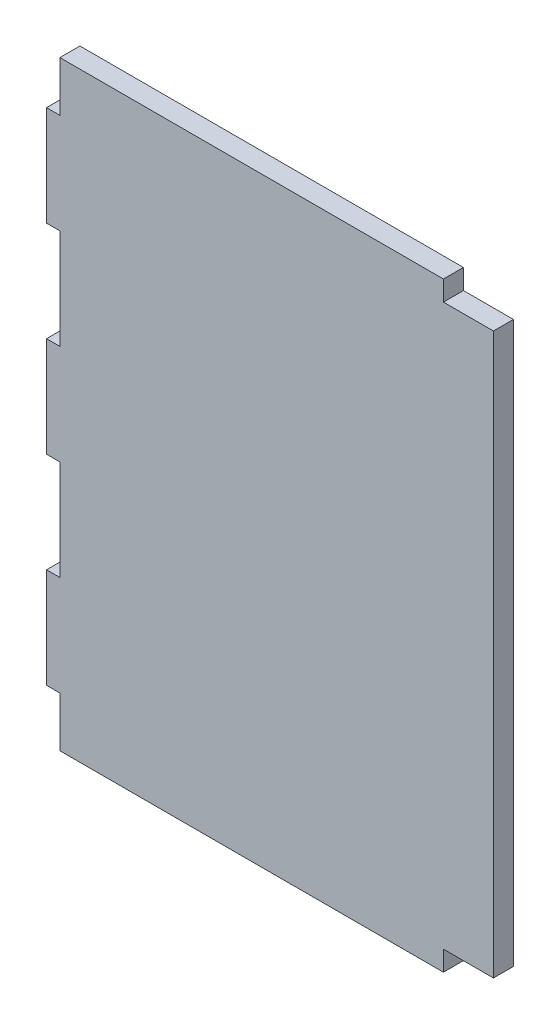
from build123d import *

# Parameters (mm, degrees)
SKETCH1_W           = 4
SKETCH1_H           = 30
BOSS_EXTRUDE1_DEPTH = 6


with BuildPart() as part:
    # Sketch1 → Boss-Extrude1 (new body)
    with BuildSketch(Plane.XY):
        Polygon((0, 15), (0, 0), (115, 0), (115, 6), (130, 6), (130, 174), (115, 174), (115, 180), (0, 180), (0, 165), (0, 135), (0, 105), (0, 75), (0, 45), align=None)
        with Locations((-2, 150)):
            Rectangle(SKETCH1_W, SKETCH1_H)
        with Locations((-2, 90)):
            Rectangle(SKETCH1_W, SKETCH1_H)
        with Locations((-2, 30)):
            Rectangle(SKETCH1_W, SKETCH1_H)
    extrude(amount=BOSS_EXTRUDE1_DEPTH)


solid = part.part
